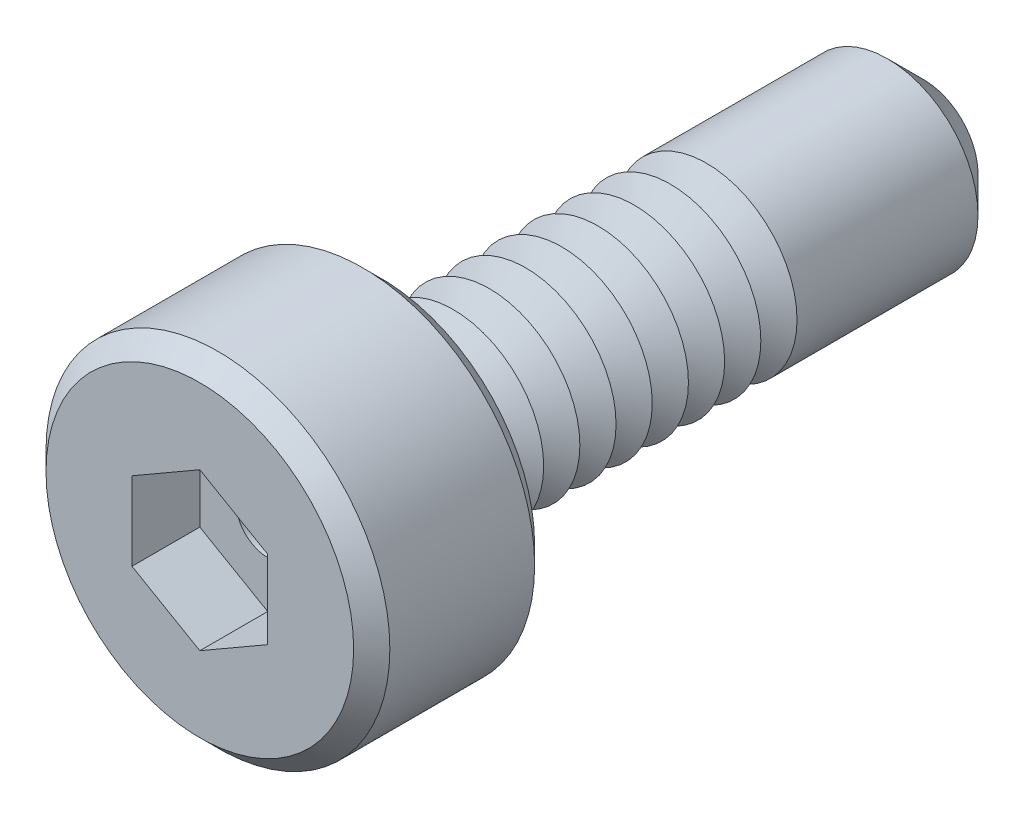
from build123d import *

# Parameters (mm, degrees)
SKETCH1_R           = 1.9
BOSS_EXTRUDE1_DEPTH = 2
SKETCH2_R           = 1
BOSS_EXTRUDE2_DEPTH = 6
CHAMFER1_SIZE       = 0.4
LPATTERN1_COUNT     = 9
LPATTERN1_PITCH     = 0.4
CUT_EXTRUDE1_DEPTH  = 0.75
SKETCH6_R           = 0.35
CUT_EXTRUDE2_DEPTH  = 7.25
CHAMFER2_SIZE       = 0.2


with BuildPart() as part:
    # Sketch1 → Boss-Extrude1 (new body)
    with BuildSketch(Plane.XY):
        Circle(SKETCH1_R)
    extrude(amount=BOSS_EXTRUDE1_DEPTH)

    # Sketch2 → Boss-Extrude2 (add)
    with BuildSketch(Plane(origin=(0, 0, 0), x_dir=(-1, 0, 0), z_dir=(0, 0, -1))):
        Circle(SKETCH2_R)
    extrude(amount=BOSS_EXTRUDE2_DEPTH)

    # Chamfer1
    chamfer1_edges = [part.edges().sort_by_distance(p)[0] for p in [
        (1, 0, -6),
    ]]
    chamfer(chamfer1_edges, length=CHAMFER1_SIZE)

    # Sketch4 → Cut-Revolve1 (revolve, cut)
    with BuildSketch(Plane(origin=(0, 0, 0), x_dir=(0, 0, -1), z_dir=(1, 0, 0)), mode=Mode.PRIVATE) as cut_revolve1_sk:
        Polygon((0, 1), (0.2, 0.653589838), (0.4, 1), align=None)
    cut_revolve1 = revolve(cut_revolve1_sk.sketch.rotate(Axis((0, 0, 2.512122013), (0, 0, -1)), 90), axis=Axis((0, 0, 2.512122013), (0, 0, -1)), mode=Mode.SUBTRACT)

    # LPattern1: Cut-Revolve1 ×9
    with Locations(*[(0, 0, -i * LPATTERN1_PITCH) for i in range(1, LPATTERN1_COUNT)]):
        add(cut_revolve1, mode=Mode.SUBTRACT)

    # Sketch5 → Cut-Extrude1 (cut)
    with BuildSketch(Plane.XY.offset(2)):
        Polygon((0, 0.866025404), (-0.75, 0.433012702), (-0.75, -0.433012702), (0, -0.866025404), (0.75, -0.433012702), (0.75, 0.433012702), align=None)
    extrude(amount=-CUT_EXTRUDE1_DEPTH, mode=Mode.SUBTRACT)

    # Sketch6 → Cut-Extrude2 (cut)
    with BuildSketch(Plane.XY.offset(1.25)):
        Circle(SKETCH6_R)
    extrude(amount=-CUT_EXTRUDE2_DEPTH, mode=Mode.SUBTRACT)

    # Chamfer2
    chamfer2_edges = [part.edges().sort_by_distance(p)[0] for p in [
        (-1.9, 0, 0),
        (-1.9, 0, 2),
    ]]
    chamfer(chamfer2_edges, length=CHAMFER2_SIZE)


solid = part.part
